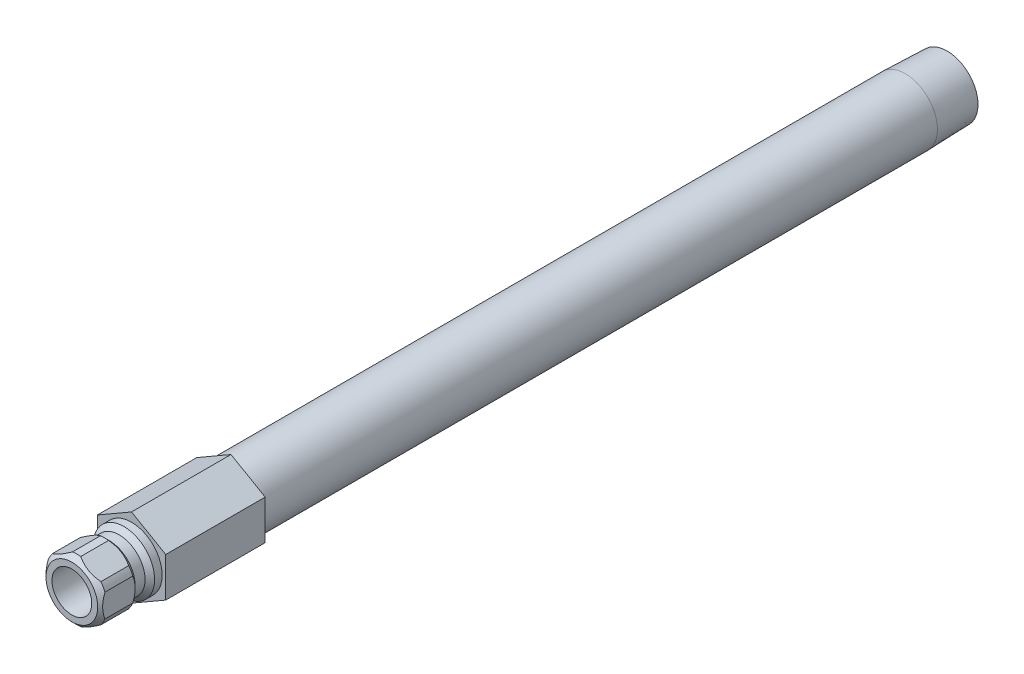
from build123d import *

# Parameters (mm, degrees)
SKETCH2_R           = 2.38125
BOSS_EXTRUDE1_DEPTH = 15.875
CUT_EXTRUDE1_START  = 3.556
SKETCH3_OUTSIDE_W   = 41.06
SKETCH3_OUTSIDE_H   = 42.75
CUT_EXTRUDE1_DEPTH  = 127.886004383


with BuildPart() as part:
    # Sketch1 → Revolve1 (revolve)
    with BuildSketch(Plane(origin=(0, 0, 0), x_dir=(0, 0, -1), z_dir=(1, 0, 0))):
        Polygon((-9.525, 3.175), (-9.525, 4.1275), (-8.763, 4.8895), (-4.318, 4.8895), (-3.556, 4.1275), (-1.9685, 4.1275), (-1.2065, 4.8895), (0, 4.8895), (0, 5.1435), (123.4948, 5.1435), (130.175, 4.934744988), (130.175, 2.38125), (0.127, 2.38125), (0.127, 3.175), align=None)
    revolve(axis=Axis((0, 0, 0), (0, 0, 1)))

    # Sketch2 → Boss-Extrude1 (add)
    with BuildSketch(Plane.XY):
        Polygon((-5.461, 3.15290982), (-5.461, -3.15290982), (0, -6.30581964), (5.461, -3.15290982), (5.461, 3.15290982), (0, 6.30581964), align=None)
        with Locations(Location((0, 0, 0), (0, 0, 90))):
            Circle(SKETCH2_R, mode=Mode.SUBTRACT)
    extrude(amount=-BOSS_EXTRUDE1_DEPTH)

    # Sketch3 outside → Cut-Extrude1 (cut, through all)
    with BuildSketch(Plane.XY.offset(CUT_EXTRUDE1_START)):
        Rectangle(SKETCH3_OUTSIDE_W, SKETCH3_OUTSIDE_H)
        Polygon((-4.5212, -2.610316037), (0, -5.220632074), (4.5212, -2.610316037), (4.5212, 2.610316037), (0, 5.220632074), (-4.5212, 2.610316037), align=None, mode=Mode.SUBTRACT)
    extrude(amount=CUT_EXTRUDE1_DEPTH, mode=Mode.SUBTRACT)


solid = part.part
